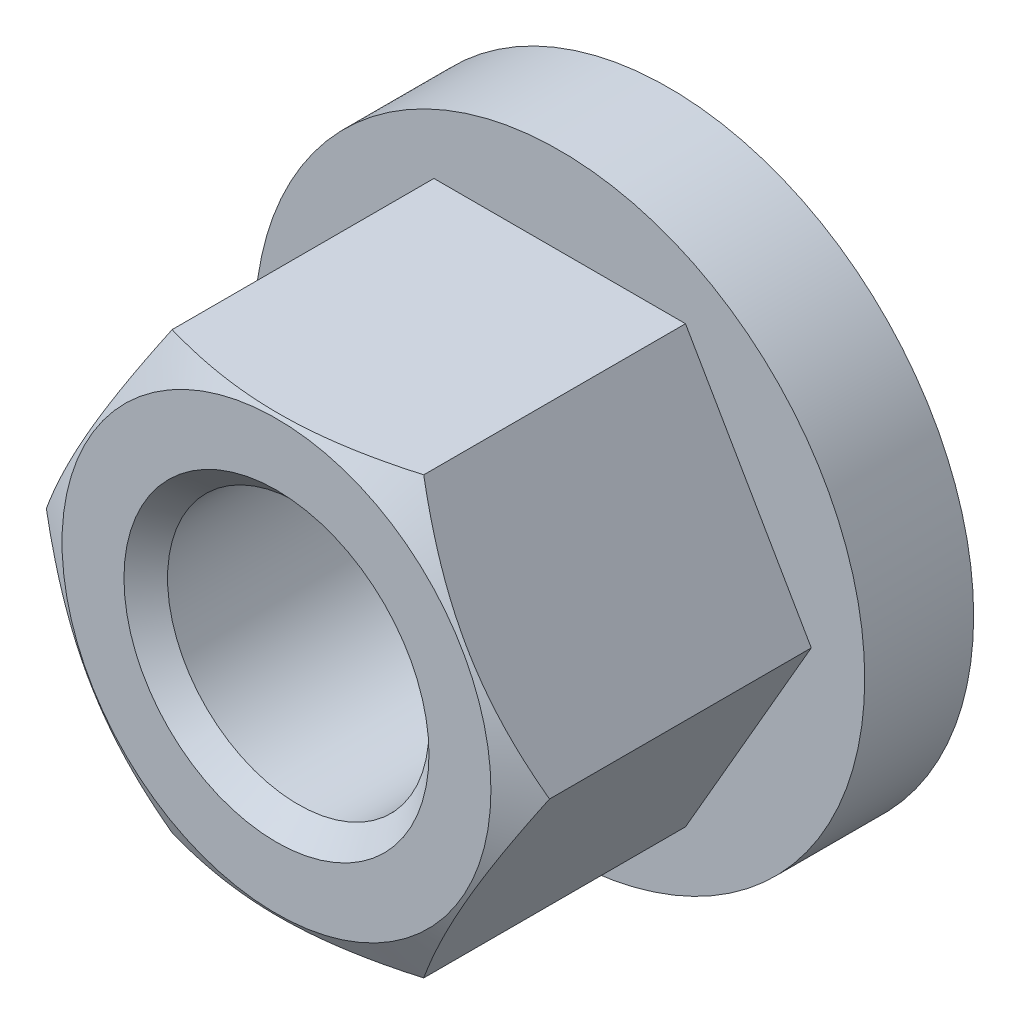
ISO-10303-21;
HEADER;
FILE_DESCRIPTION(('STEP AP214'),'2;1');
FILE_NAME('part.step','',(''),(''),'','','');
FILE_SCHEMA(('AUTOMOTIVE_DESIGN { 1 0 10303 214 1 1 1 1 }'));
ENDSEC;
DATA;
#1=APPLICATION_CONTEXT('core data for automotive mechanical design processes');
#2=APPLICATION_PROTOCOL_DEFINITION('international standard','automotive_design',2000,#1);
#3=PRODUCT_CONTEXT('',#1,'mechanical');
#4=PRODUCT('Part','Part','',(#3));
#5=PRODUCT_RELATED_PRODUCT_CATEGORY('part','',(#4));
#6=PRODUCT_DEFINITION_FORMATION('','',#4);
#7=PRODUCT_DEFINITION_CONTEXT('part definition',#1,'design');
#8=PRODUCT_DEFINITION('design','',#6,#7);
#9=PRODUCT_DEFINITION_SHAPE('','',#8);
#10=(LENGTH_UNIT() NAMED_UNIT(*) SI_UNIT(.MILLI.,.METRE.));
#11=(NAMED_UNIT(*) PLANE_ANGLE_UNIT() SI_UNIT($,.RADIAN.));
#12=(NAMED_UNIT(*) SI_UNIT($,.STERADIAN.) SOLID_ANGLE_UNIT());
#13=UNCERTAINTY_MEASURE_WITH_UNIT(LENGTH_MEASURE(1.E-05),#10,'distance_accuracy_value','');
#14=(GEOMETRIC_REPRESENTATION_CONTEXT(3) GLOBAL_UNCERTAINTY_ASSIGNED_CONTEXT((#13)) GLOBAL_UNIT_ASSIGNED_CONTEXT((#10,
#11,#12)) REPRESENTATION_CONTEXT('',''));
#15=CARTESIAN_POINT('',(0.,0.,0.));
#16=DIRECTION('',(0.,0.,1.));
#17=DIRECTION('',(1.,0.,0.));
#18=AXIS2_PLACEMENT_3D('',#15,#16,#17);
#19=CARTESIAN_POINT('',(0.,0.,9.));
#20=DIRECTION('',(0.,0.,1.));
#21=DIRECTION('',(1.,0.,0.));
#22=AXIS2_PLACEMENT_3D('',#19,#20,#21);
#23=PLANE('',#22);
#24=CARTESIAN_POINT('',(0.,0.,9.));
#25=DIRECTION('',(0.,0.,1.));
#26=DIRECTION('',(1.,0.,0.));
#27=AXIS2_PLACEMENT_3D('',#24,#25,#26);
#28=CIRCLE('',#27,3.50000000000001);
#29=CARTESIAN_POINT('',(3.50000000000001,0.,9.));
#30=VERTEX_POINT('',#29);
#31=EDGE_CURVE('E42',#30,#30,#28,.F.);
#32=ORIENTED_EDGE('',*,*,#31,.T.);
#33=EDGE_LOOP('',(#32));
#34=FACE_BOUND('',#33,.T.);
#35=CARTESIAN_POINT('',(0.,0.,9.));
#36=DIRECTION('',(0.,0.,1.));
#37=DIRECTION('',(1.,0.,0.));
#38=AXIS2_PLACEMENT_3D('',#35,#36,#37);
#39=CIRCLE('',#38,4.92153903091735);
#40=CARTESIAN_POINT('',(4.92153903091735,0.,9.));
#41=VERTEX_POINT('',#40);
#42=EDGE_CURVE('E121',#41,#41,#39,.T.);
#43=ORIENTED_EDGE('',*,*,#42,.T.);
#44=EDGE_LOOP('',(#43));
#45=FACE_BOUND('',#44,.T.);
#46=ADVANCED_FACE('F34',(#34,#45),#23,.T.);
#47=CARTESIAN_POINT('',(0.,0.,0.));
#48=DIRECTION('',(0.,0.,1.));
#49=DIRECTION('',(1.,0.,0.));
#50=AXIS2_PLACEMENT_3D('',#47,#48,#49);
#51=PLANE('',#50);
#52=CARTESIAN_POINT('',(0.,0.,0.));
#53=DIRECTION('',(0.,0.,1.));
#54=DIRECTION('',(1.,0.,0.));
#55=AXIS2_PLACEMENT_3D('',#52,#53,#54);
#56=CIRCLE('',#55,3.50000000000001);
#57=CARTESIAN_POINT('',(3.50000000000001,0.,0.));
#58=VERTEX_POINT('',#57);
#59=EDGE_CURVE('E12',#58,#58,#56,.T.);
#60=ORIENTED_EDGE('',*,*,#59,.T.);
#61=EDGE_LOOP('',(#60));
#62=FACE_BOUND('',#61,.T.);
#63=CARTESIAN_POINT('',(0.,0.,0.));
#64=DIRECTION('',(0.,0.,1.));
#65=DIRECTION('',(1.,0.,0.));
#66=AXIS2_PLACEMENT_3D('',#63,#64,#65);
#67=CIRCLE('',#66,7.);
#68=CARTESIAN_POINT('',(7.,0.,0.));
#69=VERTEX_POINT('',#68);
#70=EDGE_CURVE('E196',#69,#69,#67,.T.);
#71=ORIENTED_EDGE('',*,*,#70,.F.);
#72=EDGE_LOOP('',(#71));
#73=FACE_BOUND('',#72,.T.);
#74=ADVANCED_FACE('F184',(#62,#73),#51,.F.);
#75=CARTESIAN_POINT('',(0.,0.,9.));
#76=DIRECTION('',(0.,0.,-1.));
#77=DIRECTION('',(-1.,0.,0.));
#78=AXIS2_PLACEMENT_3D('',#75,#76,#77);
#79=CONICAL_SURFACE('',#78,4.92153903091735,1.0471975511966);
#80=CARTESIAN_POINT('',(-7.74840726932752,-5.,6.51736150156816));
#81=CARTESIAN_POINT('',(-7.53007493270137,-5.,6.62324908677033));
#82=CARTESIAN_POINT('',(-7.31124078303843,-5.,6.7281197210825));
#83=CARTESIAN_POINT('',(-6.87230198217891,-5.,6.93525502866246));
#84=CARTESIAN_POINT('',(-6.65219713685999,-5.,7.03751929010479));
#85=CARTESIAN_POINT('',(-6.20931324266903,-5.,7.23938552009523));
#86=CARTESIAN_POINT('',(-5.98652615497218,-5.,7.33896991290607));
#87=CARTESIAN_POINT('',(-5.53917801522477,-5.,7.53405575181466));
#88=CARTESIAN_POINT('',(-5.31461704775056,-5.,7.62955739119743));
#89=CARTESIAN_POINT('',(-4.8561329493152,-5.,7.81837767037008));
#90=CARTESIAN_POINT('',(-4.62214030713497,-5.,7.91152844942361));
#91=CARTESIAN_POINT('',(-4.15141526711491,-5.,8.0907660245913));
#92=CARTESIAN_POINT('',(-3.91468256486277,-5.,8.1768520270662));
#93=CARTESIAN_POINT('',(-3.43854583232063,-5.,8.33969591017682));
#94=CARTESIAN_POINT('',(-3.19914834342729,-5.,8.41647272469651));
#95=CARTESIAN_POINT('',(-2.71691926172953,-5.,8.55823069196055));
#96=CARTESIAN_POINT('',(-2.47408877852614,-5.,8.62321556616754));
#97=CARTESIAN_POINT('',(-1.98620566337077,-5.,8.73792093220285));
#98=CARTESIAN_POINT('',(-1.74117284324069,-5.,8.78772413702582));
#99=CARTESIAN_POINT('',(-1.24806583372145,-5.,8.86924822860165));
#100=CARTESIAN_POINT('',(-0.999991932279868,-5.,8.90097081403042));
#101=CARTESIAN_POINT('',(-0.505279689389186,-5.,8.94338774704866));
#102=CARTESIAN_POINT('',(-0.258665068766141,-5.,8.95435193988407));
#103=CARTESIAN_POINT('',(0.234613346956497,-5.,8.95503243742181));
#104=CARTESIAN_POINT('',(0.481277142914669,-5.,8.94474833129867));
#105=CARTESIAN_POINT('',(0.900211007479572,-5.,8.90996345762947));
#106=CARTESIAN_POINT('',(1.072929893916,-5.,8.89056052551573));
#107=CARTESIAN_POINT('',(1.41709196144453,-5.,8.84254748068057));
#108=CARTESIAN_POINT('',(1.58853496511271,-5.,8.81393611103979));
#109=CARTESIAN_POINT('',(2.10072860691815,-5.,8.71579432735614));
#110=CARTESIAN_POINT('',(2.43915009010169,-5.,8.63397445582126));
#111=CARTESIAN_POINT('',(2.94516774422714,-5.,8.49224294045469));
#112=CARTESIAN_POINT('',(3.11539074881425,-5.,8.44117687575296));
#113=CARTESIAN_POINT('',(3.45418288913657,-5.,8.33377741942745));
#114=CARTESIAN_POINT('',(3.62275201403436,-5.,8.27744399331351));
#115=CARTESIAN_POINT('',(3.95829045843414,-5.,8.16041077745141));
#116=CARTESIAN_POINT('',(4.12526029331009,-5.,8.09971245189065));
#117=CARTESIAN_POINT('',(4.45781910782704,-5.,7.97465987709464));
#118=CARTESIAN_POINT('',(4.62340810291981,-5.,7.91030566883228));
#119=CARTESIAN_POINT('',(5.01119737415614,-5.,7.75545273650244));
#120=CARTESIAN_POINT('',(5.23289477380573,-5.,7.66369708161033));
#121=CARTESIAN_POINT('',(5.67442621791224,-5.,7.4757949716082));
#122=CARTESIAN_POINT('',(5.89426015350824,-5.,7.37964826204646));
#123=CARTESIAN_POINT('',(6.33240411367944,-5.,7.18383814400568));
#124=CARTESIAN_POINT('',(6.5507138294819,-5.,7.08417404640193));
#125=CARTESIAN_POINT('',(6.98602360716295,-5.,6.88202142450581));
#126=CARTESIAN_POINT('',(7.20302364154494,-5.,6.77953284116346));
#127=CARTESIAN_POINT('',(7.85280357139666,-5.,6.46844684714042));
#128=CARTESIAN_POINT('',(8.28394083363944,-5.,6.25642061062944));
#129=CARTESIAN_POINT('',(9.14310905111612,-5.,5.82616609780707));
#130=CARTESIAN_POINT('',(9.57113989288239,-5.,5.60793759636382));
#131=CARTESIAN_POINT('',(10.1937846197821,-5.,5.28641170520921));
#132=CARTESIAN_POINT('',(10.3893024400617,-5.,5.18485969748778));
#133=CARTESIAN_POINT('',(10.7799120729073,-5.,4.98094819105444));
#134=CARTESIAN_POINT('',(10.9750038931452,-5.,4.87858870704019));
#135=CARTESIAN_POINT('',(11.5597431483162,-5.,4.57045358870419));
#136=CARTESIAN_POINT('',(11.9488382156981,-4.99999999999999,4.36362965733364));
#137=CARTESIAN_POINT('',(12.7249360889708,-4.99999999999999,3.94835851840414));
#138=CARTESIAN_POINT('',(13.1119416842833,-4.99999999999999,3.73991651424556));
#139=CARTESIAN_POINT('',(13.8850185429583,-4.99999999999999,3.32135615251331));
#140=CARTESIAN_POINT('',(14.2710898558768,-4.99999999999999,3.11123788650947));
#141=CARTESIAN_POINT('',(14.6568163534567,-4.99999999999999,2.90049247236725));
#142=B_SPLINE_CURVE_WITH_KNOTS('',3,(#80,#81,#82,#83,#84,#85,#86,#87,#88,#89,#90,#91,#92,#93,
#94,#95,#96,#97,#98,#99,#100,#101,#102,#103,#104,#105,#106,#107,#108,#109,#110,#111,#112,#113,
#114,#115,#116,#117,#118,#119,#120,#121,#122,#123,#124,#125,#126,#127,#128,#129,#130,#131,#132,
#133,#134,#135,#136,#137,#138,#139,#140,#141),.UNSPECIFIED.,.F.,.F.,(4,2,2,2,2,2,2,2,2,2,2,2,2,
2,2,2,2,2,2,2,2,2,2,2,2,2,2,2,2,2,4),(0.,0.727972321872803,1.45605896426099,2.18811921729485,
2.92014477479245,3.6756137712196,4.43116751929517,5.18515781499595,5.93890974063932,
6.68847847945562,7.43797678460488,8.17766336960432,8.91736425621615,9.43852722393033,
9.95976135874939,11.0028109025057,11.5359195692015,12.0690317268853,12.6019658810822,
13.1348940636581,13.8546358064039,14.5744193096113,15.2943446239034,16.014285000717,
17.4555568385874,18.896881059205,19.5578335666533,20.2187740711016,21.5407096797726,
22.8594141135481,24.1780469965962),.UNSPECIFIED.);
#143=CARTESIAN_POINT('',(2.88675134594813,-5.,8.50811855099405));
#144=VERTEX_POINT('',#143);
#145=CARTESIAN_POINT('',(-2.88675134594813,-5.,8.50811855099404));
#146=VERTEX_POINT('',#145);
#147=EDGE_CURVE('E91',#144,#146,#142,.F.);
#148=ORIENTED_EDGE('',*,*,#147,.F.);
#149=CARTESIAN_POINT('',(5.7736181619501,0.000200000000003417,8.50805188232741));
#150=CARTESIAN_POINT('',(5.64675433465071,-0.219534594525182,8.58131397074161));
#151=CARTESIAN_POINT('',(5.5188054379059,-0.441148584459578,8.64794921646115));
#152=CARTESIAN_POINT('',(5.26069210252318,-0.888213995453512,8.76426154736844));
#153=CARTESIAN_POINT('',(5.13052307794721,-1.11367335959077,8.81389748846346));
#154=CARTESIAN_POINT('',(4.87177839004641,-1.56183230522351,8.89114951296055));
#155=CARTESIAN_POINT('',(4.74324302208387,-1.78446209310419,8.91928016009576));
#156=CARTESIAN_POINT('',(4.54998783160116,-2.11918990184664,8.94450561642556));
#157=CARTESIAN_POINT('',(4.48552534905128,-2.23084219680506,8.95008707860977));
#158=CARTESIAN_POINT('',(4.35654081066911,-2.4542499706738,8.95549832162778));
#159=CARTESIAN_POINT('',(4.2920187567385,-2.56600544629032,8.95532828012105));
#160=CARTESIAN_POINT('',(4.11524635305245,-2.87218423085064,8.94694690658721));
#161=CARTESIAN_POINT('',(4.00305457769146,-3.06650608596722,8.932870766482));
#162=CARTESIAN_POINT('',(3.77941563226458,-3.45386010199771,8.88823528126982));
#163=CARTESIAN_POINT('',(3.66796924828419,-3.64689090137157,8.85766067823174));
#164=CARTESIAN_POINT('',(3.44387972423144,-4.03502534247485,8.78123204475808));
#165=CARTESIAN_POINT('',(3.3312648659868,-4.23007999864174,8.73505415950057));
#166=CARTESIAN_POINT('',(3.10771464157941,-4.61728034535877,8.63024874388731));
#167=CARTESIAN_POINT('',(2.99677641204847,-4.80943099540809,8.57164583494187));
#168=CARTESIAN_POINT('',(2.88663587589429,-5.0002,8.50805188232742));
#169=B_SPLINE_CURVE_WITH_KNOTS('',3,(#149,#150,#151,#152,#153,#154,#155,#156,#157,#158,#159,
#160,#161,#162,#163,#164,#165,#166,#167,#168),.UNSPECIFIED.,.F.,.F.,(4,2,2,2,2,2,2,2,2,4),(0.,
0.792555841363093,1.58701660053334,2.36181537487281,2.74884076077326,3.13585419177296,
3.8096236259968,4.4840172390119,5.17336882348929,5.86136694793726),.UNSPECIFIED.);
#170=CARTESIAN_POINT('',(5.77350269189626,0.,8.50811855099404));
#171=VERTEX_POINT('',#170);
#172=EDGE_CURVE('E165',#171,#144,#169,.T.);
#173=ORIENTED_EDGE('',*,*,#172,.F.);
#174=CARTESIAN_POINT('',(2.8866358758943,5.0002,8.50805188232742));
#175=CARTESIAN_POINT('',(3.01349970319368,4.78046540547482,8.58131397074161));
#176=CARTESIAN_POINT('',(3.1414485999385,4.55885141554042,8.64794921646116));
#177=CARTESIAN_POINT('',(3.39956193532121,4.11178600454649,8.76426154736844));
#178=CARTESIAN_POINT('',(3.52973095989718,3.88632664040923,8.81389748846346));
#179=CARTESIAN_POINT('',(3.78847564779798,3.43816769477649,8.89114951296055));
#180=CARTESIAN_POINT('',(3.91701101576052,3.21553790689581,8.91928016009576));
#181=CARTESIAN_POINT('',(4.11026620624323,2.88081009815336,8.94450561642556));
#182=CARTESIAN_POINT('',(4.17472868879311,2.76915780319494,8.95008707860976));
#183=CARTESIAN_POINT('',(4.30371322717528,2.5457500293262,8.95549832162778));
#184=CARTESIAN_POINT('',(4.3682352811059,2.43399455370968,8.95532828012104));
#185=CARTESIAN_POINT('',(4.54500768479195,2.12781576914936,8.94694690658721));
#186=CARTESIAN_POINT('',(4.65719946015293,1.93349391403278,8.932870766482));
#187=CARTESIAN_POINT('',(4.88083840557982,1.54613989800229,8.88823528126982));
#188=CARTESIAN_POINT('',(4.99228478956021,1.35310909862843,8.85766067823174));
#189=CARTESIAN_POINT('',(5.21637431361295,0.964974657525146,8.78123204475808));
#190=CARTESIAN_POINT('',(5.32898917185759,0.769920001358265,8.73505415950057));
#191=CARTESIAN_POINT('',(5.55253939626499,0.382719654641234,8.63024874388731));
#192=CARTESIAN_POINT('',(5.66347762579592,0.190569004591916,8.57164583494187));
#193=CARTESIAN_POINT('',(5.7736181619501,-0.000199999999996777,8.50805188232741));
#194=B_SPLINE_CURVE_WITH_KNOTS('',3,(#174,#175,#176,#177,#178,#179,#180,#181,#182,#183,#184,
#185,#186,#187,#188,#189,#190,#191,#192,#193),.UNSPECIFIED.,.F.,.F.,(4,2,2,2,2,2,2,2,2,4),(0.,
0.792555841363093,1.58701660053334,2.36181537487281,2.74884076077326,3.13585419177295,
3.8096236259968,4.48401723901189,5.17336882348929,5.86136694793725),.UNSPECIFIED.);
#195=CARTESIAN_POINT('',(2.88675134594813,5.,8.50811855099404));
#196=VERTEX_POINT('',#195);
#197=EDGE_CURVE('E160',#196,#171,#194,.T.);
#198=ORIENTED_EDGE('',*,*,#197,.F.);
#199=CARTESIAN_POINT('',(-7.74840726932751,5.,6.51736150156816));
#200=CARTESIAN_POINT('',(-7.53007493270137,5.,6.62324908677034));
#201=CARTESIAN_POINT('',(-7.31124078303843,5.,6.7281197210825));
#202=CARTESIAN_POINT('',(-6.8723019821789,5.,6.93525502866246));
#203=CARTESIAN_POINT('',(-6.65219713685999,5.,7.03751929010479));
#204=CARTESIAN_POINT('',(-6.20931324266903,5.,7.23938552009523));
#205=CARTESIAN_POINT('',(-5.98652615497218,5.,7.33896991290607));
#206=CARTESIAN_POINT('',(-5.53917801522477,5.,7.53405575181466));
#207=CARTESIAN_POINT('',(-5.31461704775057,5.,7.62955739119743));
#208=CARTESIAN_POINT('',(-4.8561329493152,5.,7.81837767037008));
#209=CARTESIAN_POINT('',(-4.62214030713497,5.,7.91152844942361));
#210=CARTESIAN_POINT('',(-4.15141526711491,5.,8.0907660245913));
#211=CARTESIAN_POINT('',(-3.91468256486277,5.,8.1768520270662));
#212=CARTESIAN_POINT('',(-3.43854583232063,5.,8.33969591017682));
#213=CARTESIAN_POINT('',(-3.19914834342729,5.,8.41647272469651));
#214=CARTESIAN_POINT('',(-2.71691926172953,5.,8.55823069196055));
#215=CARTESIAN_POINT('',(-2.47408877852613,5.,8.62321556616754));
#216=CARTESIAN_POINT('',(-1.98620566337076,5.,8.73792093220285));
#217=CARTESIAN_POINT('',(-1.74117284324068,5.,8.78772413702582));
#218=CARTESIAN_POINT('',(-1.24806583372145,5.,8.86924822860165));
#219=CARTESIAN_POINT('',(-0.999991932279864,5.,8.90097081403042));
#220=CARTESIAN_POINT('',(-0.505279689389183,5.,8.94338774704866));
#221=CARTESIAN_POINT('',(-0.258665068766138,5.,8.95435193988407));
#222=CARTESIAN_POINT('',(0.234613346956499,5.,8.95503243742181));
#223=CARTESIAN_POINT('',(0.481277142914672,5.,8.94474833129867));
#224=CARTESIAN_POINT('',(0.900211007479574,5.,8.90996345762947));
#225=CARTESIAN_POINT('',(1.07292989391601,5.,8.89056052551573));
#226=CARTESIAN_POINT('',(1.41709196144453,5.,8.84254748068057));
#227=CARTESIAN_POINT('',(1.58853496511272,5.,8.81393611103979));
#228=CARTESIAN_POINT('',(2.10072860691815,5.,8.71579432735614));
#229=CARTESIAN_POINT('',(2.4391500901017,5.,8.63397445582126));
#230=CARTESIAN_POINT('',(2.94516774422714,5.,8.49224294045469));
#231=CARTESIAN_POINT('',(3.11539074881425,5.,8.44117687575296));
#232=CARTESIAN_POINT('',(3.45418288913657,5.,8.33377741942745));
#233=CARTESIAN_POINT('',(3.62275201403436,5.,8.2774439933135));
#234=CARTESIAN_POINT('',(3.95829045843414,5.,8.16041077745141));
#235=CARTESIAN_POINT('',(4.12526029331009,5.,8.09971245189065));
#236=CARTESIAN_POINT('',(4.45781910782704,5.,7.97465987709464));
#237=CARTESIAN_POINT('',(4.62340810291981,5.,7.91030566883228));
#238=CARTESIAN_POINT('',(5.01119737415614,5.,7.75545273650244));
#239=CARTESIAN_POINT('',(5.23289477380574,5.,7.66369708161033));
#240=CARTESIAN_POINT('',(5.67442621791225,5.,7.47579497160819));
#241=CARTESIAN_POINT('',(5.89426015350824,5.,7.37964826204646));
#242=CARTESIAN_POINT('',(6.33240411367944,5.,7.18383814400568));
#243=CARTESIAN_POINT('',(6.55071382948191,5.,7.08417404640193));
#244=CARTESIAN_POINT('',(6.98602360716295,5.,6.88202142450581));
#245=CARTESIAN_POINT('',(7.20302364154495,5.,6.77953284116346));
#246=CARTESIAN_POINT('',(7.85280357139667,5.,6.46844684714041));
#247=CARTESIAN_POINT('',(8.28394083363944,5.,6.25642061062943));
#248=CARTESIAN_POINT('',(9.14310905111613,5.,5.82616609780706));
#249=CARTESIAN_POINT('',(9.5711398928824,5.,5.60793759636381));
#250=CARTESIAN_POINT('',(10.1937846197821,5.,5.2864117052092));
#251=CARTESIAN_POINT('',(10.3893024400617,5.,5.18485969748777));
#252=CARTESIAN_POINT('',(10.7799120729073,5.,4.98094819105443));
#253=CARTESIAN_POINT('',(10.9750038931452,5.,4.87858870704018));
#254=CARTESIAN_POINT('',(11.5597431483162,5.,4.57045358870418));
#255=CARTESIAN_POINT('',(11.9488382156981,5.,4.36362965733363));
#256=CARTESIAN_POINT('',(12.7249360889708,5.,3.94835851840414));
#257=CARTESIAN_POINT('',(13.1119416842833,5.,3.73991651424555));
#258=CARTESIAN_POINT('',(13.8850185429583,5.,3.32135615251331));
#259=CARTESIAN_POINT('',(14.2710898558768,5.,3.11123788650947));
#260=CARTESIAN_POINT('',(14.6568163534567,5.,2.90049247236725));
#261=B_SPLINE_CURVE_WITH_KNOTS('',3,(#199,#200,#201,#202,#203,#204,#205,#206,#207,#208,#209,
#210,#211,#212,#213,#214,#215,#216,#217,#218,#219,#220,#221,#222,#223,#224,#225,#226,#227,#228,
#229,#230,#231,#232,#233,#234,#235,#236,#237,#238,#239,#240,#241,#242,#243,#244,#245,#246,#247,
#248,#249,#250,#251,#252,#253,#254,#255,#256,#257,#258,#259,#260),.UNSPECIFIED.,.F.,.F.,(4,2,2,
2,2,2,2,2,2,2,2,2,2,2,2,2,2,2,2,2,2,2,2,2,2,2,2,2,2,2,4),(0.,0.727972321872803,1.45605896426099,
2.18811921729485,2.92014477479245,3.6756137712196,4.43116751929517,5.18515781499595,
5.93890974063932,6.68847847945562,7.43797678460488,8.17766336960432,8.91736425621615,
9.43852722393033,9.95976135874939,11.0028109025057,11.5359195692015,12.0690317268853,
12.6019658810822,13.1348940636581,13.8546358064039,14.5744193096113,15.2943446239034,
16.014285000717,17.4555568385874,18.8968810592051,19.5578335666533,20.2187740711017,
21.5407096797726,22.8594141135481,24.1780469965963),.UNSPECIFIED.);
#262=CARTESIAN_POINT('',(-2.88675134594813,5.,8.50811855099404));
#263=VERTEX_POINT('',#262);
#264=EDGE_CURVE('E155',#263,#196,#261,.T.);
#265=ORIENTED_EDGE('',*,*,#264,.F.);
#266=CARTESIAN_POINT('',(-5.7736181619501,-0.000199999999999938,8.50805188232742));
#267=CARTESIAN_POINT('',(-5.64675433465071,0.219534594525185,8.58131397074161));
#268=CARTESIAN_POINT('',(-5.5188054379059,0.441148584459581,8.64794921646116));
#269=CARTESIAN_POINT('',(-5.26069210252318,0.888213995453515,8.76426154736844));
#270=CARTESIAN_POINT('',(-5.13052307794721,1.11367335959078,8.81389748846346));
#271=CARTESIAN_POINT('',(-4.87177839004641,1.56183230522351,8.89114951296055));
#272=CARTESIAN_POINT('',(-4.74324302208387,1.7844620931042,8.91928016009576));
#273=CARTESIAN_POINT('',(-4.54998783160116,2.11918990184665,8.94450561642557));
#274=CARTESIAN_POINT('',(-4.48552534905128,2.23084219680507,8.95008707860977));
#275=CARTESIAN_POINT('',(-4.35654081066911,2.4542499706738,8.95549832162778));
#276=CARTESIAN_POINT('',(-4.2920187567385,2.56600544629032,8.95532828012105));
#277=CARTESIAN_POINT('',(-4.11524635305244,2.87218423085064,8.94694690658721));
#278=CARTESIAN_POINT('',(-4.00305457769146,3.06650608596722,8.932870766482));
#279=CARTESIAN_POINT('',(-3.77941563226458,3.45386010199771,8.88823528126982));
#280=CARTESIAN_POINT('',(-3.66796924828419,3.64689090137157,8.85766067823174));
#281=CARTESIAN_POINT('',(-3.44387972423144,4.03502534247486,8.78123204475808));
#282=CARTESIAN_POINT('',(-3.3312648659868,4.23007999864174,8.73505415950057));
#283=CARTESIAN_POINT('',(-3.10771464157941,4.61728034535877,8.63024874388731));
#284=CARTESIAN_POINT('',(-2.99677641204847,4.80943099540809,8.57164583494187));
#285=CARTESIAN_POINT('',(-2.88663587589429,5.0002,8.50805188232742));
#286=B_SPLINE_CURVE_WITH_KNOTS('',3,(#266,#267,#268,#269,#270,#271,#272,#273,#274,#275,#276,
#277,#278,#279,#280,#281,#282,#283,#284,#285),.UNSPECIFIED.,.F.,.F.,(4,2,2,2,2,2,2,2,2,4),(0.,
0.792555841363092,1.58701660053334,2.36181537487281,2.74884076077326,3.13585419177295,
3.8096236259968,4.4840172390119,5.17336882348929,5.86136694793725),.UNSPECIFIED.);
#287=CARTESIAN_POINT('',(-5.77350269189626,0.,8.50811855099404));
#288=VERTEX_POINT('',#287);
#289=EDGE_CURVE('E130',#288,#263,#286,.T.);
#290=ORIENTED_EDGE('',*,*,#289,.F.);
#291=CARTESIAN_POINT('',(-2.8866358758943,-5.0002,8.50805188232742));
#292=CARTESIAN_POINT('',(-3.01349970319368,-4.78046540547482,8.58131397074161));
#293=CARTESIAN_POINT('',(-3.14144859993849,-4.55885141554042,8.64794921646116));
#294=CARTESIAN_POINT('',(-3.39956193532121,-4.11178600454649,8.76426154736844));
#295=CARTESIAN_POINT('',(-3.52973095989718,-3.88632664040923,8.81389748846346));
#296=CARTESIAN_POINT('',(-3.78847564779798,-3.43816769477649,8.89114951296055));
#297=CARTESIAN_POINT('',(-3.91701101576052,-3.2155379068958,8.91928016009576));
#298=CARTESIAN_POINT('',(-4.11026620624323,-2.88081009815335,8.94450561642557));
#299=CARTESIAN_POINT('',(-4.17472868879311,-2.76915780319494,8.95008707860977));
#300=CARTESIAN_POINT('',(-4.30371322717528,-2.5457500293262,8.95549832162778));
#301=CARTESIAN_POINT('',(-4.36823528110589,-2.43399455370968,8.95532828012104));
#302=CARTESIAN_POINT('',(-4.54500768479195,-2.12781576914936,8.94694690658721));
#303=CARTESIAN_POINT('',(-4.65719946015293,-1.93349391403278,8.932870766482));
#304=CARTESIAN_POINT('',(-4.88083840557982,-1.54613989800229,8.88823528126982));
#305=CARTESIAN_POINT('',(-4.99228478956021,-1.35310909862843,8.85766067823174));
#306=CARTESIAN_POINT('',(-5.21637431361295,-0.964974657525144,8.78123204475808));
#307=CARTESIAN_POINT('',(-5.32898917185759,-0.769920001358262,8.73505415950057));
#308=CARTESIAN_POINT('',(-5.55253939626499,-0.38271965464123,8.63024874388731));
#309=CARTESIAN_POINT('',(-5.66347762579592,-0.190569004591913,8.57164583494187));
#310=CARTESIAN_POINT('',(-5.7736181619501,0.000200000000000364,8.50805188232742));
#311=B_SPLINE_CURVE_WITH_KNOTS('',3,(#291,#292,#293,#294,#295,#296,#297,#298,#299,#300,#301,
#302,#303,#304,#305,#306,#307,#308,#309,#310),.UNSPECIFIED.,.F.,.F.,(4,2,2,2,2,2,2,2,2,4),(0.,
0.792555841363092,1.58701660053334,2.36181537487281,2.74884076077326,3.13585419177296,
3.8096236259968,4.4840172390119,5.17336882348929,5.86136694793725),.UNSPECIFIED.);
#312=EDGE_CURVE('E106',#146,#288,#311,.T.);
#313=ORIENTED_EDGE('',*,*,#312,.F.);
#314=EDGE_LOOP('',(#148,#173,#198,#265,#290,#313));
#315=FACE_BOUND('',#314,.T.);
#316=ORIENTED_EDGE('',*,*,#42,.F.);
#317=EDGE_LOOP('',(#316));
#318=FACE_BOUND('',#317,.T.);
#319=ADVANCED_FACE('F136',(#315,#318),#79,.T.);
#320=CARTESIAN_POINT('',(-2.88675134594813,-5.,9.));
#321=DIRECTION('',(0.,1.,0.));
#322=DIRECTION('',(-1.,0.,0.));
#323=AXIS2_PLACEMENT_3D('',#320,#321,#322);
#324=PLANE('',#323);
#325=DIRECTION('',(0.,0.,-1.));
#326=VECTOR('',#325,1.);
#327=CARTESIAN_POINT('',(-2.88675134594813,-5.,9.));
#328=LINE('',#327,#326);
#329=CARTESIAN_POINT('',(-2.88675134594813,-5.,2.5));
#330=VERTEX_POINT('',#329);
#331=EDGE_CURVE('E56',#146,#330,#328,.T.);
#332=ORIENTED_EDGE('',*,*,#331,.T.);
#333=DIRECTION('',(1.,0.,0.));
#334=VECTOR('',#333,1.);
#335=CARTESIAN_POINT('',(-2.88675134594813,-5.,2.5));
#336=LINE('',#335,#334);
#337=CARTESIAN_POINT('',(2.88675134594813,-5.,2.5));
#338=VERTEX_POINT('',#337);
#339=EDGE_CURVE('E49',#330,#338,#336,.T.);
#340=ORIENTED_EDGE('',*,*,#339,.T.);
#341=DIRECTION('',(0.,0.,-1.));
#342=VECTOR('',#341,1.);
#343=CARTESIAN_POINT('',(2.88675134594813,-5.,9.));
#344=LINE('',#343,#342);
#345=EDGE_CURVE('E118',#144,#338,#344,.T.);
#346=ORIENTED_EDGE('',*,*,#345,.F.);
#347=ORIENTED_EDGE('',*,*,#147,.T.);
#348=EDGE_LOOP('',(#332,#340,#346,#347));
#349=FACE_BOUND('',#348,.T.);
#350=ADVANCED_FACE('F177',(#349),#324,.F.);
#351=CARTESIAN_POINT('',(2.88675134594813,-5.,9.));
#352=DIRECTION('',(-0.866025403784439,0.5,0.));
#353=DIRECTION('',(-0.5,-0.866025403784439,0.));
#354=AXIS2_PLACEMENT_3D('',#351,#352,#353);
#355=PLANE('',#354);
#356=ORIENTED_EDGE('',*,*,#345,.T.);
#357=DIRECTION('',(0.5,0.866025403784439,0.));
#358=VECTOR('',#357,1.);
#359=CARTESIAN_POINT('',(2.88675134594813,-5.,2.5));
#360=LINE('',#359,#358);
#361=CARTESIAN_POINT('',(5.77350269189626,0.,2.5));
#362=VERTEX_POINT('',#361);
#363=EDGE_CURVE('E206',#338,#362,#360,.T.);
#364=ORIENTED_EDGE('',*,*,#363,.T.);
#365=DIRECTION('',(0.,0.,-1.));
#366=VECTOR('',#365,1.);
#367=CARTESIAN_POINT('',(5.77350269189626,0.,9.));
#368=LINE('',#367,#366);
#369=EDGE_CURVE('E115',#171,#362,#368,.T.);
#370=ORIENTED_EDGE('',*,*,#369,.F.);
#371=ORIENTED_EDGE('',*,*,#172,.T.);
#372=EDGE_LOOP('',(#356,#364,#370,#371));
#373=FACE_BOUND('',#372,.T.);
#374=ADVANCED_FACE('F174',(#373),#355,.F.);
#375=CARTESIAN_POINT('',(5.77350269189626,0.,9.));
#376=DIRECTION('',(-0.866025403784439,-0.5,0.));
#377=DIRECTION('',(0.5,-0.866025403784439,0.));
#378=AXIS2_PLACEMENT_3D('',#375,#376,#377);
#379=PLANE('',#378);
#380=ORIENTED_EDGE('',*,*,#369,.T.);
#381=DIRECTION('',(-0.5,0.866025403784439,0.));
#382=VECTOR('',#381,1.);
#383=CARTESIAN_POINT('',(5.77350269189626,0.,2.5));
#384=LINE('',#383,#382);
#385=CARTESIAN_POINT('',(2.88675134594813,5.,2.5));
#386=VERTEX_POINT('',#385);
#387=EDGE_CURVE('E203',#362,#386,#384,.T.);
#388=ORIENTED_EDGE('',*,*,#387,.T.);
#389=DIRECTION('',(0.,0.,-1.));
#390=VECTOR('',#389,1.);
#391=CARTESIAN_POINT('',(2.88675134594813,5.,9.));
#392=LINE('',#391,#390);
#393=EDGE_CURVE('E108',#196,#386,#392,.T.);
#394=ORIENTED_EDGE('',*,*,#393,.F.);
#395=ORIENTED_EDGE('',*,*,#197,.T.);
#396=EDGE_LOOP('',(#380,#388,#394,#395));
#397=FACE_BOUND('',#396,.T.);
#398=ADVANCED_FACE('F151',(#397),#379,.F.);
#399=CARTESIAN_POINT('',(2.88675134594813,5.,9.));
#400=DIRECTION('',(0.,-1.,0.));
#401=DIRECTION('',(1.,0.,0.));
#402=AXIS2_PLACEMENT_3D('',#399,#400,#401);
#403=PLANE('',#402);
#404=ORIENTED_EDGE('',*,*,#393,.T.);
#405=DIRECTION('',(-1.,0.,0.));
#406=VECTOR('',#405,1.);
#407=CARTESIAN_POINT('',(2.88675134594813,5.,2.5));
#408=LINE('',#407,#406);
#409=CARTESIAN_POINT('',(-2.88675134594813,5.,2.5));
#410=VERTEX_POINT('',#409);
#411=EDGE_CURVE('E101',#386,#410,#408,.T.);
#412=ORIENTED_EDGE('',*,*,#411,.T.);
#413=DIRECTION('',(0.,0.,-1.));
#414=VECTOR('',#413,1.);
#415=CARTESIAN_POINT('',(-2.88675134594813,5.,9.));
#416=LINE('',#415,#414);
#417=EDGE_CURVE('E100',#263,#410,#416,.T.);
#418=ORIENTED_EDGE('',*,*,#417,.F.);
#419=ORIENTED_EDGE('',*,*,#264,.T.);
#420=EDGE_LOOP('',(#404,#412,#418,#419));
#421=FACE_BOUND('',#420,.T.);
#422=ADVANCED_FACE('F147',(#421),#403,.F.);
#423=CARTESIAN_POINT('',(-2.88675134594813,5.,9.));
#424=DIRECTION('',(0.866025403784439,-0.5,0.));
#425=DIRECTION('',(0.5,0.866025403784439,0.));
#426=AXIS2_PLACEMENT_3D('',#423,#424,#425);
#427=PLANE('',#426);
#428=ORIENTED_EDGE('',*,*,#417,.T.);
#429=DIRECTION('',(-0.5,-0.866025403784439,0.));
#430=VECTOR('',#429,1.);
#431=CARTESIAN_POINT('',(-2.88675134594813,5.,2.5));
#432=LINE('',#431,#430);
#433=CARTESIAN_POINT('',(-5.77350269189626,0.,2.5));
#434=VERTEX_POINT('',#433);
#435=EDGE_CURVE('E87',#410,#434,#432,.T.);
#436=ORIENTED_EDGE('',*,*,#435,.T.);
#437=DIRECTION('',(0.,0.,-1.));
#438=VECTOR('',#437,1.);
#439=CARTESIAN_POINT('',(-5.77350269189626,0.,9.));
#440=LINE('',#439,#438);
#441=EDGE_CURVE('E97',#288,#434,#440,.T.);
#442=ORIENTED_EDGE('',*,*,#441,.F.);
#443=ORIENTED_EDGE('',*,*,#289,.T.);
#444=EDGE_LOOP('',(#428,#436,#442,#443));
#445=FACE_BOUND('',#444,.T.);
#446=ADVANCED_FACE('F96',(#445),#427,.F.);
#447=CARTESIAN_POINT('',(-5.77350269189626,0.,9.));
#448=DIRECTION('',(0.866025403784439,0.5,0.));
#449=DIRECTION('',(-0.5,0.866025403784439,0.));
#450=AXIS2_PLACEMENT_3D('',#447,#448,#449);
#451=PLANE('',#450);
#452=ORIENTED_EDGE('',*,*,#441,.T.);
#453=DIRECTION('',(0.5,-0.866025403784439,0.));
#454=VECTOR('',#453,1.);
#455=CARTESIAN_POINT('',(-5.77350269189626,0.,2.5));
#456=LINE('',#455,#454);
#457=EDGE_CURVE('E84',#434,#330,#456,.T.);
#458=ORIENTED_EDGE('',*,*,#457,.T.);
#459=ORIENTED_EDGE('',*,*,#331,.F.);
#460=ORIENTED_EDGE('',*,*,#312,.T.);
#461=EDGE_LOOP('',(#452,#458,#459,#460));
#462=FACE_BOUND('',#461,.T.);
#463=ADVANCED_FACE('F104',(#462),#451,.F.);
#464=CARTESIAN_POINT('',(0.,0.,2.5));
#465=DIRECTION('',(0.,0.,1.));
#466=DIRECTION('',(1.,0.,0.));
#467=AXIS2_PLACEMENT_3D('',#464,#465,#466);
#468=PLANE('',#467);
#469=CARTESIAN_POINT('',(0.,0.,2.5));
#470=DIRECTION('',(0.,0.,1.));
#471=DIRECTION('',(1.,0.,0.));
#472=AXIS2_PLACEMENT_3D('',#469,#470,#471);
#473=CIRCLE('',#472,7.);
#474=CARTESIAN_POINT('',(7.,0.,2.5));
#475=VERTEX_POINT('',#474);
#476=EDGE_CURVE('E102',#475,#475,#473,.T.);
#477=ORIENTED_EDGE('',*,*,#476,.T.);
#478=EDGE_LOOP('',(#477));
#479=FACE_BOUND('',#478,.T.);
#480=ORIENTED_EDGE('',*,*,#339,.F.);
#481=ORIENTED_EDGE('',*,*,#457,.F.);
#482=ORIENTED_EDGE('',*,*,#435,.F.);
#483=ORIENTED_EDGE('',*,*,#411,.F.);
#484=ORIENTED_EDGE('',*,*,#387,.F.);
#485=ORIENTED_EDGE('',*,*,#363,.F.);
#486=EDGE_LOOP('',(#480,#481,#482,#483,#484,#485));
#487=FACE_BOUND('',#486,.T.);
#488=ADVANCED_FACE('F86',(#479,#487),#468,.T.);
#489=CARTESIAN_POINT('',(0.,0.,2.5));
#490=DIRECTION('',(0.,0.,-1.));
#491=DIRECTION('',(-1.,0.,0.));
#492=AXIS2_PLACEMENT_3D('',#489,#490,#491);
#493=CYLINDRICAL_SURFACE('',#492,7.);
#494=ORIENTED_EDGE('',*,*,#476,.F.);
#495=EDGE_LOOP('',(#494));
#496=FACE_BOUND('',#495,.T.);
#497=ORIENTED_EDGE('',*,*,#70,.T.);
#498=EDGE_LOOP('',(#497));
#499=FACE_BOUND('',#498,.T.);
#500=ADVANCED_FACE('F142',(#496,#499),#493,.T.);
#501=CARTESIAN_POINT('',(0.,0.,9.));
#502=DIRECTION('',(0.,0.,-1.));
#503=DIRECTION('',(-1.,0.,0.));
#504=AXIS2_PLACEMENT_3D('',#501,#502,#503);
#505=CYLINDRICAL_SURFACE('',#504,3.);
#506=CARTESIAN_POINT('',(0.,0.,8.49999999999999));
#507=DIRECTION('',(0.,0.,1.));
#508=DIRECTION('',(1.,0.,0.));
#509=AXIS2_PLACEMENT_3D('',#506,#507,#508);
#510=CIRCLE('',#509,3.);
#511=CARTESIAN_POINT('',(3.,0.,8.49999999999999));
#512=VERTEX_POINT('',#511);
#513=EDGE_CURVE('E320',#512,#512,#510,.T.);
#514=ORIENTED_EDGE('',*,*,#513,.T.);
#515=EDGE_LOOP('',(#514));
#516=FACE_BOUND('',#515,.T.);
#517=CARTESIAN_POINT('',(0.,0.,0.500000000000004));
#518=DIRECTION('',(0.,0.,1.));
#519=DIRECTION('',(1.,0.,0.));
#520=AXIS2_PLACEMENT_3D('',#517,#518,#519);
#521=CIRCLE('',#520,3.);
#522=CARTESIAN_POINT('',(3.,0.,0.500000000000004));
#523=VERTEX_POINT('',#522);
#524=EDGE_CURVE('E90',#523,#523,#521,.F.);
#525=ORIENTED_EDGE('',*,*,#524,.T.);
#526=EDGE_LOOP('',(#525));
#527=FACE_BOUND('',#526,.T.);
#528=ADVANCED_FACE('F246',(#516,#527),#505,.F.);
#529=CARTESIAN_POINT('',(0.,0.,8.49999999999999));
#530=DIRECTION('',(0.,0.,1.));
#531=DIRECTION('',(1.,0.,0.));
#532=AXIS2_PLACEMENT_3D('',#529,#530,#531);
#533=CONICAL_SURFACE('',#532,3.,0.785398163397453);
#534=ORIENTED_EDGE('',*,*,#31,.F.);
#535=EDGE_LOOP('',(#534));
#536=FACE_BOUND('',#535,.T.);
#537=ORIENTED_EDGE('',*,*,#513,.F.);
#538=EDGE_LOOP('',(#537));
#539=FACE_BOUND('',#538,.T.);
#540=ADVANCED_FACE('F254',(#536,#539),#533,.F.);
#541=CARTESIAN_POINT('',(0.,0.,0.));
#542=DIRECTION('',(0.,0.,-1.));
#543=DIRECTION('',(-1.,0.,0.));
#544=AXIS2_PLACEMENT_3D('',#541,#542,#543);
#545=CONICAL_SURFACE('',#544,3.50000000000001,0.785398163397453);
#546=ORIENTED_EDGE('',*,*,#524,.F.);
#547=EDGE_LOOP('',(#546));
#548=FACE_BOUND('',#547,.T.);
#549=ORIENTED_EDGE('',*,*,#59,.F.);
#550=EDGE_LOOP('',(#549));
#551=FACE_BOUND('',#550,.T.);
#552=ADVANCED_FACE('F36',(#548,#551),#545,.F.);
#553=CLOSED_SHELL('',(#46,#74,#319,#350,#374,#398,#422,#446,#463,#488,#500,#528,#540,#552));
#554=MANIFOLD_SOLID_BREP('B2',#553);
#555=ADVANCED_BREP_SHAPE_REPRESENTATION('',(#18,#554),#14);
#556=SHAPE_DEFINITION_REPRESENTATION(#9,#555);
ENDSEC;
END-ISO-10303-21;
